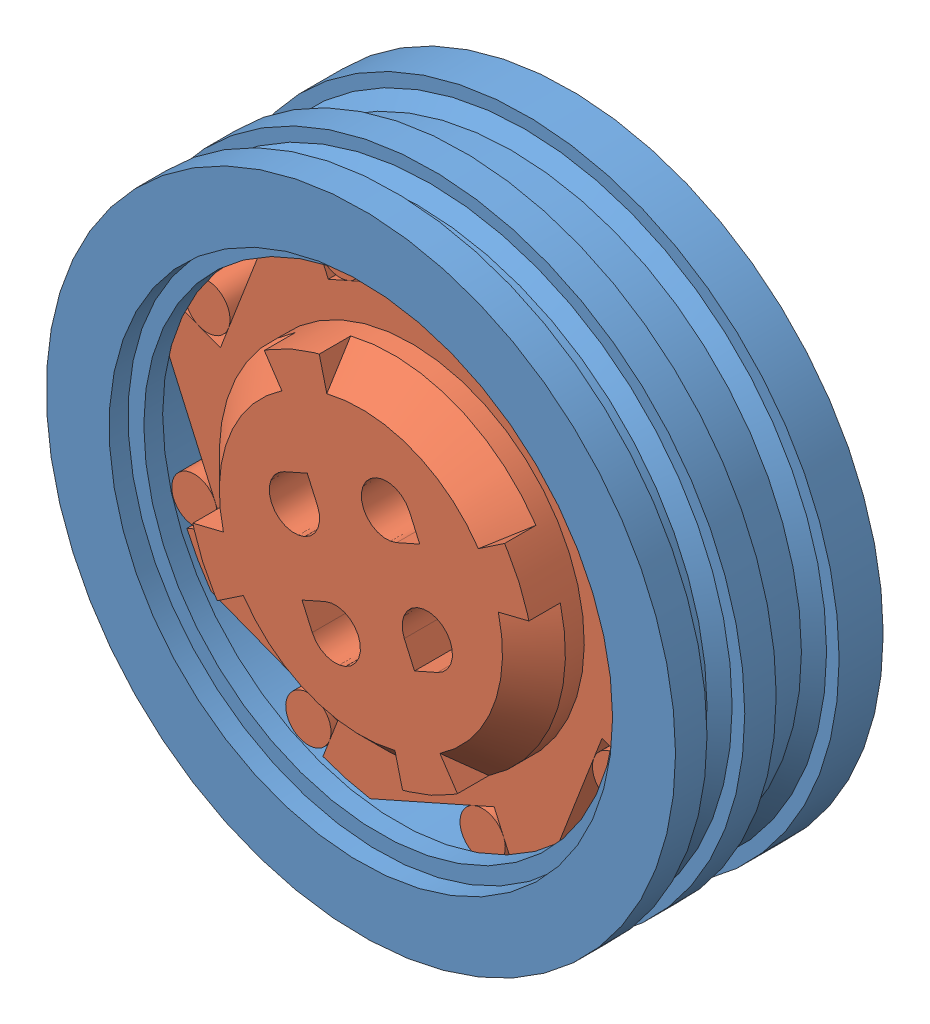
SolidWorks assembly Assem1.SLDASM, configuration Default (file format 12000). Lengths in mm.
Overall size (2661.22 2661.22 838.2).
2 component instances, 2 part files, 2 mates.
Components (placement in the parent):
- P1-2: P1.SLDPRT [Default] at (538.2431 1657.5641 2063.135) size (2540 2540 838.2)
- P2-3: P2.SLDPRT [Default] at (538.2431 1657.5641 2063.135) x (-0.405421 0.91413 0) z (0 0 1) size (2016.76 2016.76 838.2)
Mates (geometry in assembly coordinates):
- Coincident3: coincident aligned: plane of P1-2 through (538.2431 1657.5641 2901.335) normal (0 0 1); plane of P2-3 through (538.2431 1657.5641 2901.335) normal (0 0 1)
- Concentric3: concentric anti-aligned: circle of P1-2; circle of P2-3
